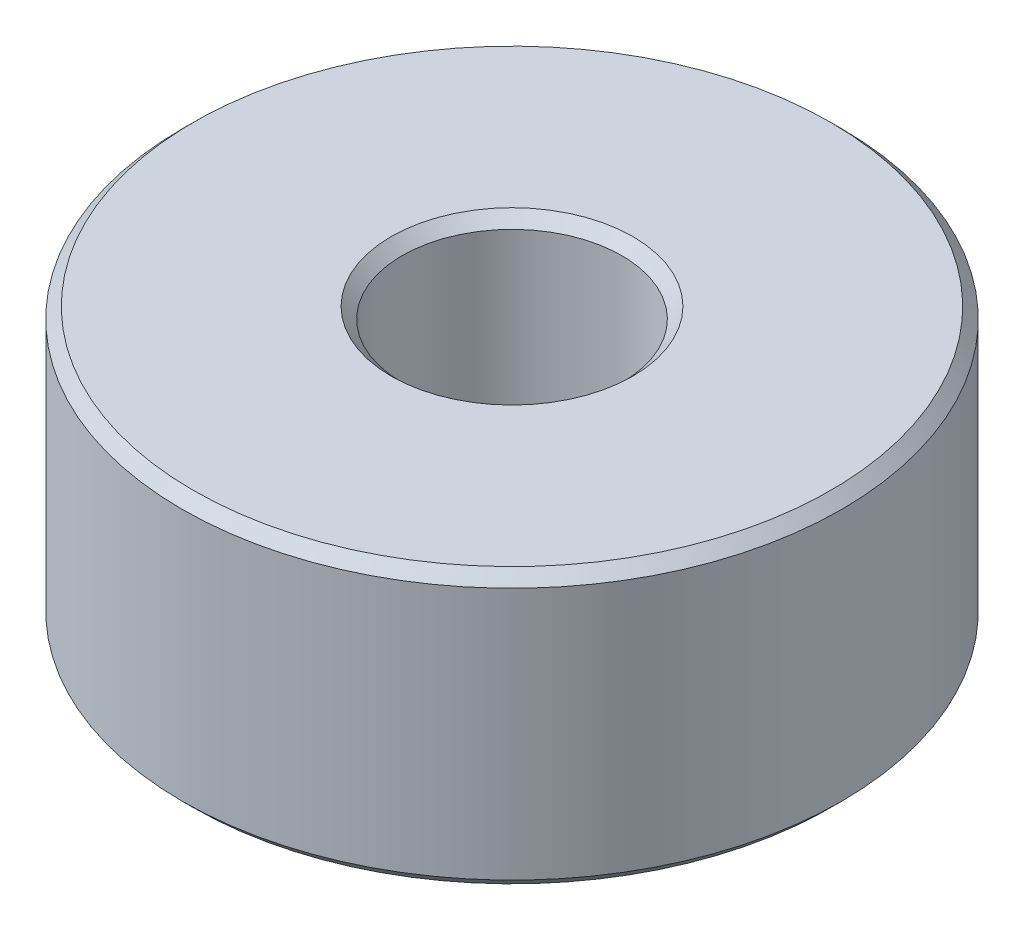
from build123d import *

# Parameters (mm, degrees)
SKETCH1_R           = 3
BOSS_EXTRUDE1_DEPTH = 2.5
SKETCH2_R           = 1
CUT_EXTRUDE1_DEPTH  = 5.5
CHAMFER1_SIZE       = 0.1


with BuildPart() as part:
    # Sketch1 → Boss-Extrude1 (new body)
    with BuildSketch(Plane(origin=(0, 0, 0), x_dir=(1, 0, 0), z_dir=(0, 1, 0))):
        with Locations(Location((0, 0, 0), (0, 0, 270))):
            Circle(SKETCH1_R)
    extrude(amount=BOSS_EXTRUDE1_DEPTH)

    # Sketch2 → Cut-Extrude1 (cut)
    with BuildSketch(Plane(origin=(0, 2.5, 0), x_dir=(1, 0, 0), z_dir=(0, 1, 0))):
        with Locations(Location((0, 0, 0), (0, 0, 270))):
            Circle(SKETCH2_R)
    extrude(amount=-CUT_EXTRUDE1_DEPTH, mode=Mode.SUBTRACT)

    # Chamfer1
    chamfer1_edges = [part.edges().sort_by_distance(p)[0] for p in [
        (0, 0, -3),
        (0, 2.5, -3),
        (0, 2.5, -1),
    ]]
    chamfer(chamfer1_edges, length=CHAMFER1_SIZE)


solid = part.part
